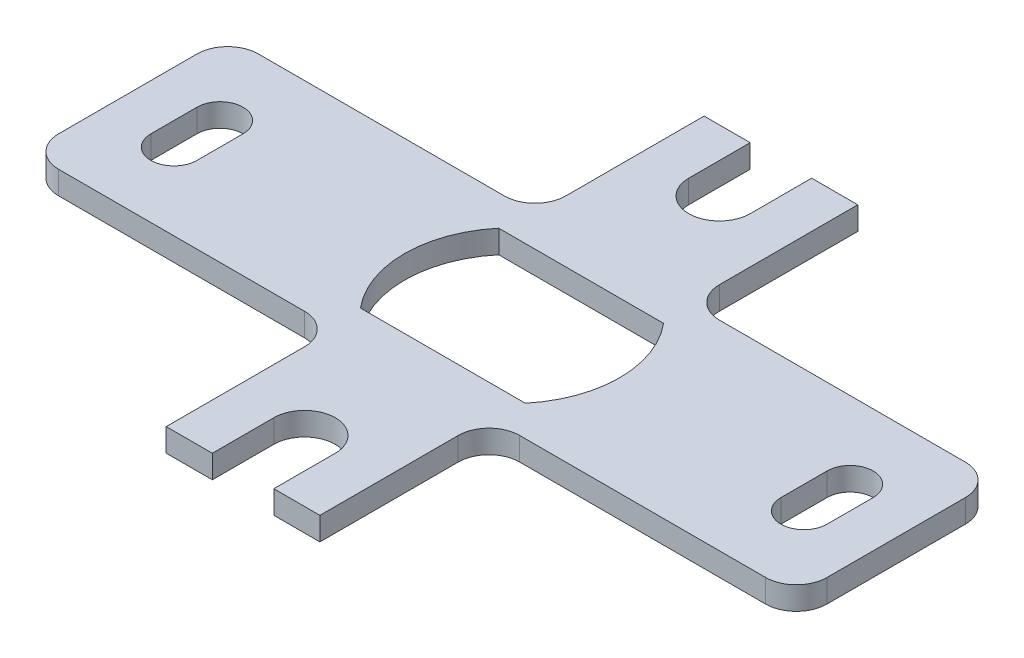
from build123d import *

# Parameters (mm, degrees)
EXTRUDE1_DEPTH = 3


with BuildPart() as part:
    # Sketch1 → Extrude1 (new body)
    with BuildSketch(Plane(origin=(0, 0, 0), x_dir=(1, 0, 0), z_dir=(0, 1, 0))):
        with BuildLine():
            Line((40, 0), (46, 0))
            Line((46, 0), (46, 8))
            ThreePointArc((46, 8), (50, 12), (54, 8))
            Line((54, 8), (54, 0))
            Line((54, 0), (60, 0))
            Line((60, 0), (60, 18))
            ThreePointArc((60, 18), (61.171572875, 20.828427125), (64, 22))
            Line((64, 22), (96, 22))
            ThreePointArc((96, 22), (98.828427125, 23.171572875), (100, 26))
            Line((100, 26), (100, 44))
            ThreePointArc((100, 44), (98.828427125, 46.828427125), (96, 48))
            Line((96, 48), (64, 48))
            ThreePointArc((64, 48), (61.171572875, 49.171572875), (60, 52))
            Line((60, 52), (60, 70))
            Line((60, 70), (54, 70))
            Line((54, 70), (54, 62))
            ThreePointArc((54, 62), (50, 58), (46, 62))
            Line((46, 62), (46, 70))
            Line((46, 70), (40, 70))
            Line((40, 70), (40, 52))
            ThreePointArc((40, 52), (38.828427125, 49.171572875), (36, 48))
            Line((36, 48), (4, 48))
            ThreePointArc((4, 48), (1.171572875, 46.828427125), (0, 44))
            Line((0, 44), (0, 26))
            ThreePointArc((0, 26), (1.171572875, 23.171572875), (4, 22))
            Line((4, 22), (36, 22))
            ThreePointArc((36, 22), (38.828427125, 20.828427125), (40, 18))
            Line((40, 18), (40, 0))
        make_face()
        with BuildLine():
            Line((39.276194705, 44), (60.723805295, 44))
            ThreePointArc((60.723805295, 44), (64, 35), (60.723805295, 26))
            Line((60.723805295, 26), (39.276194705, 26))
            ThreePointArc((39.276194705, 26), (36, 35), (39.276194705, 44))
        make_face(mode=Mode.SUBTRACT)
        with BuildLine():
            Line((94, 38), (94, 32))
            ThreePointArc((94, 32), (91, 29), (88, 32))
            Line((88, 32), (88, 38))
            ThreePointArc((88, 38), (91, 41), (94, 38))
        make_face(mode=Mode.SUBTRACT)
        with BuildLine():
            Line((12, 38), (12, 32))
            ThreePointArc((12, 32), (9, 29), (6, 32))
            Line((6, 32), (6, 38))
            ThreePointArc((6, 38), (9, 41), (12, 38))
        make_face(mode=Mode.SUBTRACT)
    extrude(amount=EXTRUDE1_DEPTH)


solid = part.part
